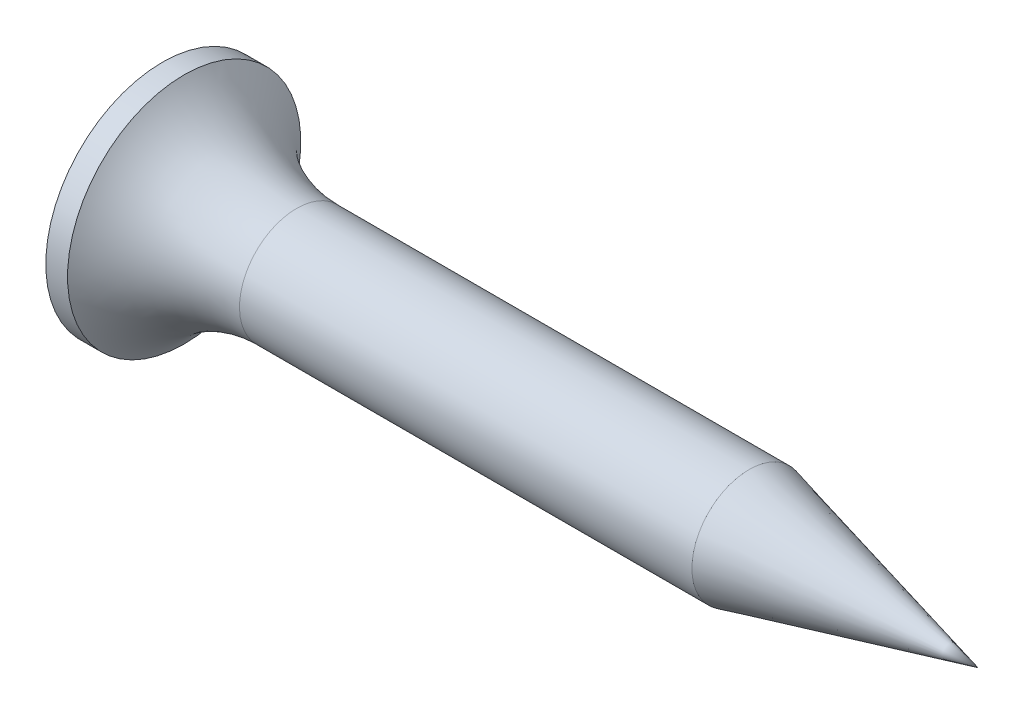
from build123d import *

# Parameters (mm, degrees)
CUT_EXTRUDE1_DEPTH = 2.03142636
DRAFT1_ANGLE       = 30


with BuildPart() as part:
    # Sketch1 → Base (revolve)
    with BuildSketch(Plane.XY):
        with BuildLine():
            Line((30, 0), (21.57736004, 2.1))
            Line((21.57736004, 2.1), (4.935686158, 2.1))
            ThreePointArc((4.935686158, 2.1), (2.595814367, 2.681289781), (0.8, 4.29))
            Line((0.8, 4.29), (0, 4.29))
            Line((0, 4.29), (0, 0))
            Line((0, 0), (30, 0))
        make_face()
    revolve(axis=Axis((30, 0, 0), (-1, 0, 0)))

    # Sketch3 → Cut-Extrude1 (cut)
    with BuildSketch(Plane(origin=(0, 0, 0), x_dir=(0, 0, -1), z_dir=(1, 0, 0))):
        Polygon((0.5, 2.5), (-0.5, 2.5), (-0.5, 0.5), (-2.5, 0.5), (-2.5, -0.5), (-0.5, -0.5), (-0.5, -2.5), (0.5, -2.5), (0.5, -0.5), (2.5, -0.5), (2.5, 0.5), (0.5, 0.5), align=None)
    extrude(amount=CUT_EXTRUDE1_DEPTH, mode=Mode.SUBTRACT)

    # Draft1
    draft1_faces = [part.faces().sort_by_distance(p)[0] for p in [
        (1.01571318, 0, 2.5),
        (1.01571318, 0, -2.5),
        (1.01571318, -2.5, 0),
        (1.01571318, 2.5, 0),
    ]]
    draft(draft1_faces, Plane(origin=(0, 4.29, 0), x_dir=(0, -1, 0), z_dir=(-1, 0, 0)), DRAFT1_ANGLE)


solid = part.part
